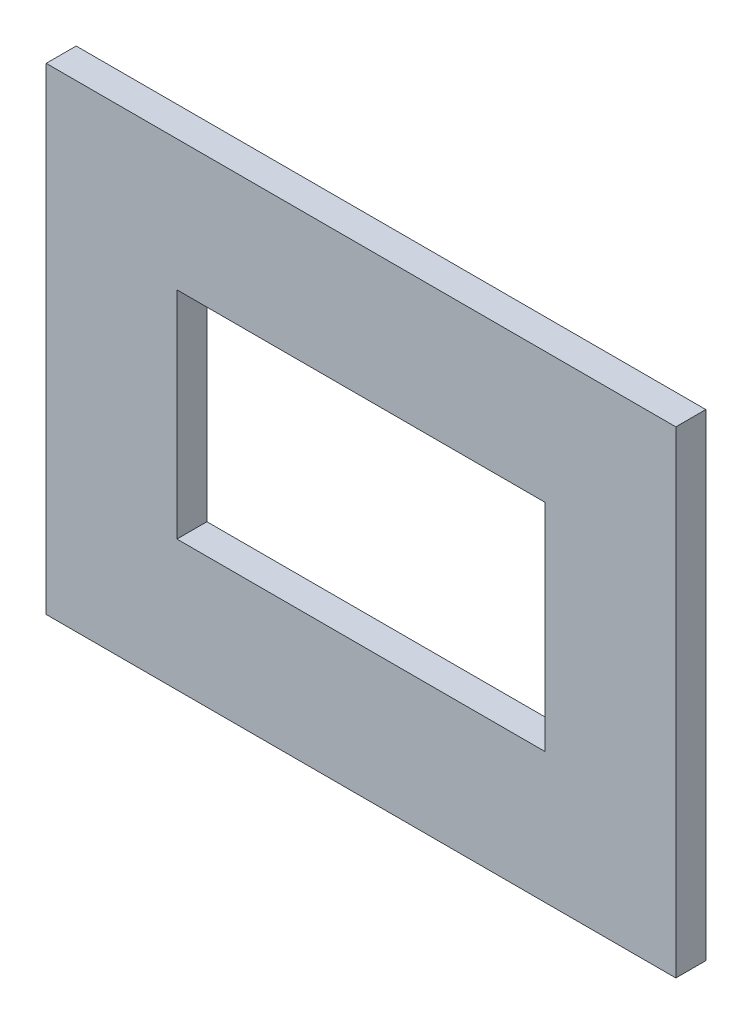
ISO-10303-21;
HEADER;
FILE_DESCRIPTION(('STEP AP214'),'2;1');
FILE_NAME('part.step','',(''),(''),'','','');
FILE_SCHEMA(('AUTOMOTIVE_DESIGN { 1 0 10303 214 1 1 1 1 }'));
ENDSEC;
DATA;
#1=APPLICATION_CONTEXT('core data for automotive mechanical design processes');
#2=APPLICATION_PROTOCOL_DEFINITION('international standard','automotive_design',2000,#1);
#3=PRODUCT_CONTEXT('',#1,'mechanical');
#4=PRODUCT('Part','Part','',(#3));
#5=PRODUCT_RELATED_PRODUCT_CATEGORY('part','',(#4));
#6=PRODUCT_DEFINITION_FORMATION('','',#4);
#7=PRODUCT_DEFINITION_CONTEXT('part definition',#1,'design');
#8=PRODUCT_DEFINITION('design','',#6,#7);
#9=PRODUCT_DEFINITION_SHAPE('','',#8);
#10=(LENGTH_UNIT() NAMED_UNIT(*) SI_UNIT(.MILLI.,.METRE.));
#11=(NAMED_UNIT(*) PLANE_ANGLE_UNIT() SI_UNIT($,.RADIAN.));
#12=(NAMED_UNIT(*) SI_UNIT($,.STERADIAN.) SOLID_ANGLE_UNIT());
#13=UNCERTAINTY_MEASURE_WITH_UNIT(LENGTH_MEASURE(1.E-05),#10,'distance_accuracy_value','');
#14=(GEOMETRIC_REPRESENTATION_CONTEXT(3) GLOBAL_UNCERTAINTY_ASSIGNED_CONTEXT((#13)) GLOBAL_UNIT_ASSIGNED_CONTEXT((#10,
#11,#12)) REPRESENTATION_CONTEXT('',''));
#15=CARTESIAN_POINT('',(0.,0.,0.));
#16=DIRECTION('',(0.,0.,1.));
#17=DIRECTION('',(1.,0.,0.));
#18=AXIS2_PLACEMENT_3D('',#15,#16,#17);
#19=CARTESIAN_POINT('',(0.,0.,15.));
#20=DIRECTION('',(0.,0.,1.));
#21=DIRECTION('',(1.,0.,0.));
#22=AXIS2_PLACEMENT_3D('',#19,#20,#21);
#23=PLANE('',#22);
#24=DIRECTION('',(1.,0.,0.));
#25=VECTOR('',#24,1.);
#26=CARTESIAN_POINT('',(-1.8801817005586E-13,-119.339078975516,15.));
#27=LINE('',#26,#25);
#28=CARTESIAN_POINT('',(-157.475,-119.339078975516,15.));
#29=VERTEX_POINT('',#28);
#30=CARTESIAN_POINT('',(157.439078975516,-119.339078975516,15.));
#31=VERTEX_POINT('',#30);
#32=EDGE_CURVE('E99',#29,#31,#27,.T.);
#33=ORIENTED_EDGE('',*,*,#32,.T.);
#34=DIRECTION('',(0.,1.,0.));
#35=VECTOR('',#34,1.);
#36=CARTESIAN_POINT('',(157.439078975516,1.80411241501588E-13,15.));
#37=LINE('',#36,#35);
#38=CARTESIAN_POINT('',(157.439078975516,119.375,15.));
#39=VERTEX_POINT('',#38);
#40=EDGE_CURVE('E105',#31,#39,#37,.T.);
#41=ORIENTED_EDGE('',*,*,#40,.T.);
#42=DIRECTION('',(1.,0.,0.));
#43=VECTOR('',#42,1.);
#44=CARTESIAN_POINT('',(1.82814087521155E-13,119.375,15.0000000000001));
#45=LINE('',#44,#43);
#46=CARTESIAN_POINT('',(-157.475,119.374999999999,15.0000000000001));
#47=VERTEX_POINT('',#46);
#48=EDGE_CURVE('E109',#47,#39,#45,.T.);
#49=ORIENTED_EDGE('',*,*,#48,.F.);
#50=DIRECTION('',(0.,1.,0.));
#51=VECTOR('',#50,1.);
#52=CARTESIAN_POINT('',(-157.475,-1.80411241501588E-13,15.));
#53=LINE('',#52,#51);
#54=EDGE_CURVE('E102',#29,#47,#53,.T.);
#55=ORIENTED_EDGE('',*,*,#54,.F.);
#56=EDGE_LOOP('',(#33,#41,#49,#55));
#57=FACE_BOUND('',#56,.T.);
#58=DIRECTION('',(1.,0.,0.));
#59=VECTOR('',#58,1.);
#60=CARTESIAN_POINT('',(92.075,-53.975,15.));
#61=LINE('',#60,#59);
#62=CARTESIAN_POINT('',(-92.0750000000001,-53.975,15.));
#63=VERTEX_POINT('',#62);
#64=CARTESIAN_POINT('',(92.075,-53.975,15.));
#65=VERTEX_POINT('',#64);
#66=EDGE_CURVE('E134',#63,#65,#61,.T.);
#67=ORIENTED_EDGE('',*,*,#66,.F.);
#68=DIRECTION('',(0.,-1.,0.));
#69=VECTOR('',#68,1.);
#70=CARTESIAN_POINT('',(-92.0750000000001,-53.975,15.));
#71=LINE('',#70,#69);
#72=CARTESIAN_POINT('',(-92.0750000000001,53.975,15.));
#73=VERTEX_POINT('',#72);
#74=EDGE_CURVE('E132',#73,#63,#71,.T.);
#75=ORIENTED_EDGE('',*,*,#74,.F.);
#76=DIRECTION('',(-1.,0.,0.));
#77=VECTOR('',#76,1.);
#78=CARTESIAN_POINT('',(92.075,53.975,15.));
#79=LINE('',#78,#77);
#80=CARTESIAN_POINT('',(92.075,53.975,15.));
#81=VERTEX_POINT('',#80);
#82=EDGE_CURVE('E140',#81,#73,#79,.T.);
#83=ORIENTED_EDGE('',*,*,#82,.F.);
#84=DIRECTION('',(0.,1.,0.));
#85=VECTOR('',#84,1.);
#86=CARTESIAN_POINT('',(92.075,-53.975,15.));
#87=LINE('',#86,#85);
#88=EDGE_CURVE('E137',#65,#81,#87,.T.);
#89=ORIENTED_EDGE('',*,*,#88,.F.);
#90=EDGE_LOOP('',(#67,#75,#83,#89));
#91=FACE_BOUND('',#90,.T.);
#92=ADVANCED_FACE('F32',(#57,#91),#23,.T.);
#93=CARTESIAN_POINT('',(0.,0.,0.));
#94=DIRECTION('',(0.,0.,1.));
#95=DIRECTION('',(1.,0.,0.));
#96=AXIS2_PLACEMENT_3D('',#93,#94,#95);
#97=PLANE('',#96);
#98=DIRECTION('',(0.,1.,0.));
#99=VECTOR('',#98,1.);
#100=CARTESIAN_POINT('',(157.439078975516,1.80411241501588E-13,0.));
#101=LINE('',#100,#99);
#102=CARTESIAN_POINT('',(157.439078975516,-119.339078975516,0.));
#103=VERTEX_POINT('',#102);
#104=CARTESIAN_POINT('',(157.439078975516,119.375,0.));
#105=VERTEX_POINT('',#104);
#106=EDGE_CURVE('E121',#103,#105,#101,.T.);
#107=ORIENTED_EDGE('',*,*,#106,.F.);
#108=DIRECTION('',(1.,0.,0.));
#109=VECTOR('',#108,1.);
#110=CARTESIAN_POINT('',(-1.8801817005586E-13,-119.339078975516,0.));
#111=LINE('',#110,#109);
#112=CARTESIAN_POINT('',(-157.475,-119.339078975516,0.));
#113=VERTEX_POINT('',#112);
#114=EDGE_CURVE('E55',#113,#103,#111,.T.);
#115=ORIENTED_EDGE('',*,*,#114,.F.);
#116=DIRECTION('',(0.,1.,0.));
#117=VECTOR('',#116,1.);
#118=CARTESIAN_POINT('',(-157.475,-1.80411241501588E-13,0.));
#119=LINE('',#118,#117);
#120=CARTESIAN_POINT('',(-157.475,119.374999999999,0.));
#121=VERTEX_POINT('',#120);
#122=EDGE_CURVE('E112',#113,#121,#119,.T.);
#123=ORIENTED_EDGE('',*,*,#122,.T.);
#124=DIRECTION('',(1.,0.,0.));
#125=VECTOR('',#124,1.);
#126=CARTESIAN_POINT('',(1.82814087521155E-13,119.375,0.));
#127=LINE('',#126,#125);
#128=EDGE_CURVE('E115',#121,#105,#127,.T.);
#129=ORIENTED_EDGE('',*,*,#128,.T.);
#130=EDGE_LOOP('',(#107,#115,#123,#129));
#131=FACE_BOUND('',#130,.T.);
#132=DIRECTION('',(0.,-1.,0.));
#133=VECTOR('',#132,1.);
#134=CARTESIAN_POINT('',(-92.0750000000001,-53.975,0.));
#135=LINE('',#134,#133);
#136=CARTESIAN_POINT('',(-92.0750000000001,53.975,0.));
#137=VERTEX_POINT('',#136);
#138=CARTESIAN_POINT('',(-92.0750000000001,-53.975,0.));
#139=VERTEX_POINT('',#138);
#140=EDGE_CURVE('E127',#137,#139,#135,.T.);
#141=ORIENTED_EDGE('',*,*,#140,.T.);
#142=DIRECTION('',(1.,0.,0.));
#143=VECTOR('',#142,1.);
#144=CARTESIAN_POINT('',(92.075,-53.975,0.));
#145=LINE('',#144,#143);
#146=CARTESIAN_POINT('',(92.075,-53.975,0.));
#147=VERTEX_POINT('',#146);
#148=EDGE_CURVE('E145',#139,#147,#145,.T.);
#149=ORIENTED_EDGE('',*,*,#148,.T.);
#150=DIRECTION('',(0.,1.,0.));
#151=VECTOR('',#150,1.);
#152=CARTESIAN_POINT('',(92.075,-53.975,0.));
#153=LINE('',#152,#151);
#154=CARTESIAN_POINT('',(92.075,53.975,0.));
#155=VERTEX_POINT('',#154);
#156=EDGE_CURVE('E148',#147,#155,#153,.T.);
#157=ORIENTED_EDGE('',*,*,#156,.T.);
#158=DIRECTION('',(-1.,0.,0.));
#159=VECTOR('',#158,1.);
#160=CARTESIAN_POINT('',(92.075,53.975,0.));
#161=LINE('',#160,#159);
#162=EDGE_CURVE('E135',#155,#137,#161,.T.);
#163=ORIENTED_EDGE('',*,*,#162,.T.);
#164=EDGE_LOOP('',(#141,#149,#157,#163));
#165=FACE_BOUND('',#164,.T.);
#166=ADVANCED_FACE('F34',(#131,#165),#97,.F.);
#167=CARTESIAN_POINT('',(-92.0750000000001,-53.975,15.));
#168=DIRECTION('',(1.,0.,0.));
#169=DIRECTION('',(0.,0.,-1.));
#170=AXIS2_PLACEMENT_3D('',#167,#168,#169);
#171=PLANE('',#170);
#172=ORIENTED_EDGE('',*,*,#140,.F.);
#173=DIRECTION('',(0.,0.,-1.));
#174=VECTOR('',#173,1.);
#175=CARTESIAN_POINT('',(-92.0750000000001,53.975,15.));
#176=LINE('',#175,#174);
#177=EDGE_CURVE('E142',#73,#137,#176,.T.);
#178=ORIENTED_EDGE('',*,*,#177,.F.);
#179=ORIENTED_EDGE('',*,*,#74,.T.);
#180=DIRECTION('',(0.,0.,-1.));
#181=VECTOR('',#180,1.);
#182=CARTESIAN_POINT('',(-92.0750000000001,-53.975,15.));
#183=LINE('',#182,#181);
#184=EDGE_CURVE('E11',#63,#139,#183,.T.);
#185=ORIENTED_EDGE('',*,*,#184,.T.);
#186=EDGE_LOOP('',(#172,#178,#179,#185));
#187=FACE_BOUND('',#186,.T.);
#188=ADVANCED_FACE('F169',(#187),#171,.T.);
#189=CARTESIAN_POINT('',(92.075,-53.975,15.));
#190=DIRECTION('',(0.,1.,0.));
#191=DIRECTION('',(-1.,0.,0.));
#192=AXIS2_PLACEMENT_3D('',#189,#190,#191);
#193=PLANE('',#192);
#194=ORIENTED_EDGE('',*,*,#148,.F.);
#195=ORIENTED_EDGE('',*,*,#184,.F.);
#196=ORIENTED_EDGE('',*,*,#66,.T.);
#197=DIRECTION('',(0.,0.,-1.));
#198=VECTOR('',#197,1.);
#199=CARTESIAN_POINT('',(92.075,-53.975,15.));
#200=LINE('',#199,#198);
#201=EDGE_CURVE('E40',#65,#147,#200,.T.);
#202=ORIENTED_EDGE('',*,*,#201,.T.);
#203=EDGE_LOOP('',(#194,#195,#196,#202));
#204=FACE_BOUND('',#203,.T.);
#205=ADVANCED_FACE('F159',(#204),#193,.T.);
#206=CARTESIAN_POINT('',(92.075,-53.975,15.));
#207=DIRECTION('',(-1.,0.,0.));
#208=DIRECTION('',(0.,0.,1.));
#209=AXIS2_PLACEMENT_3D('',#206,#207,#208);
#210=PLANE('',#209);
#211=ORIENTED_EDGE('',*,*,#156,.F.);
#212=ORIENTED_EDGE('',*,*,#201,.F.);
#213=ORIENTED_EDGE('',*,*,#88,.T.);
#214=DIRECTION('',(0.,0.,-1.));
#215=VECTOR('',#214,1.);
#216=CARTESIAN_POINT('',(92.075,53.975,15.));
#217=LINE('',#216,#215);
#218=EDGE_CURVE('E155',#81,#155,#217,.T.);
#219=ORIENTED_EDGE('',*,*,#218,.T.);
#220=EDGE_LOOP('',(#211,#212,#213,#219));
#221=FACE_BOUND('',#220,.T.);
#222=ADVANCED_FACE('F164',(#221),#210,.T.);
#223=CARTESIAN_POINT('',(92.075,53.975,15.));
#224=DIRECTION('',(0.,-1.,0.));
#225=DIRECTION('',(1.,0.,0.));
#226=AXIS2_PLACEMENT_3D('',#223,#224,#225);
#227=PLANE('',#226);
#228=ORIENTED_EDGE('',*,*,#162,.F.);
#229=ORIENTED_EDGE('',*,*,#218,.F.);
#230=ORIENTED_EDGE('',*,*,#82,.T.);
#231=ORIENTED_EDGE('',*,*,#177,.T.);
#232=EDGE_LOOP('',(#228,#229,#230,#231));
#233=FACE_BOUND('',#232,.T.);
#234=ADVANCED_FACE('F172',(#233),#227,.T.);
#235=CARTESIAN_POINT('',(-1.8801817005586E-13,-119.339078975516,15.));
#236=DIRECTION('',(0.,1.,0.));
#237=DIRECTION('',(-1.,0.,0.));
#238=AXIS2_PLACEMENT_3D('',#235,#236,#237);
#239=PLANE('',#238);
#240=ORIENTED_EDGE('',*,*,#114,.T.);
#241=DIRECTION('',(0.,0.,-1.));
#242=VECTOR('',#241,1.);
#243=CARTESIAN_POINT('',(157.439078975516,-119.339078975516,15.));
#244=LINE('',#243,#242);
#245=EDGE_CURVE('E96',#31,#103,#244,.T.);
#246=ORIENTED_EDGE('',*,*,#245,.F.);
#247=ORIENTED_EDGE('',*,*,#32,.F.);
#248=DIRECTION('',(0.,0.,-1.));
#249=VECTOR('',#248,1.);
#250=CARTESIAN_POINT('',(-157.475,-119.339078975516,15.));
#251=LINE('',#250,#249);
#252=EDGE_CURVE('E125',#29,#113,#251,.T.);
#253=ORIENTED_EDGE('',*,*,#252,.T.);
#254=EDGE_LOOP('',(#240,#246,#247,#253));
#255=FACE_BOUND('',#254,.T.);
#256=ADVANCED_FACE('F97',(#255),#239,.F.);
#257=CARTESIAN_POINT('',(-157.475,-1.80411241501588E-13,15.));
#258=DIRECTION('',(-1.,0.,0.));
#259=DIRECTION('',(0.,-1.,0.));
#260=AXIS2_PLACEMENT_3D('',#257,#258,#259);
#261=PLANE('',#260);
#262=ORIENTED_EDGE('',*,*,#122,.F.);
#263=ORIENTED_EDGE('',*,*,#252,.F.);
#264=ORIENTED_EDGE('',*,*,#54,.T.);
#265=DIRECTION('',(0.,0.,-1.));
#266=VECTOR('',#265,1.);
#267=CARTESIAN_POINT('',(-157.475,119.374999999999,15.0000000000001));
#268=LINE('',#267,#266);
#269=EDGE_CURVE('E128',#47,#121,#268,.T.);
#270=ORIENTED_EDGE('',*,*,#269,.T.);
#271=EDGE_LOOP('',(#262,#263,#264,#270));
#272=FACE_BOUND('',#271,.T.);
#273=ADVANCED_FACE('F190',(#272),#261,.T.);
#274=CARTESIAN_POINT('',(1.82814087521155E-13,119.375,15.0000000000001));
#275=DIRECTION('',(0.,1.,0.));
#276=DIRECTION('',(-1.,0.,0.));
#277=AXIS2_PLACEMENT_3D('',#274,#275,#276);
#278=PLANE('',#277);
#279=ORIENTED_EDGE('',*,*,#128,.F.);
#280=ORIENTED_EDGE('',*,*,#269,.F.);
#281=ORIENTED_EDGE('',*,*,#48,.T.);
#282=DIRECTION('',(0.,0.,-1.));
#283=VECTOR('',#282,1.);
#284=CARTESIAN_POINT('',(157.439078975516,119.375,15.0000000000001));
#285=LINE('',#284,#283);
#286=EDGE_CURVE('E47',#39,#105,#285,.T.);
#287=ORIENTED_EDGE('',*,*,#286,.T.);
#288=EDGE_LOOP('',(#279,#280,#281,#287));
#289=FACE_BOUND('',#288,.T.);
#290=ADVANCED_FACE('F193',(#289),#278,.T.);
#291=CARTESIAN_POINT('',(157.439078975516,1.80411241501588E-13,15.));
#292=DIRECTION('',(-1.,0.,0.));
#293=DIRECTION('',(0.,-1.,0.));
#294=AXIS2_PLACEMENT_3D('',#291,#292,#293);
#295=PLANE('',#294);
#296=ORIENTED_EDGE('',*,*,#106,.T.);
#297=ORIENTED_EDGE('',*,*,#286,.F.);
#298=ORIENTED_EDGE('',*,*,#40,.F.);
#299=ORIENTED_EDGE('',*,*,#245,.T.);
#300=EDGE_LOOP('',(#296,#297,#298,#299));
#301=FACE_BOUND('',#300,.T.);
#302=ADVANCED_FACE('F106',(#301),#295,.F.);
#303=CLOSED_SHELL('',(#92,#166,#188,#205,#222,#234,#256,#273,#290,#302));
#304=MANIFOLD_SOLID_BREP('B2',#303);
#305=ADVANCED_BREP_SHAPE_REPRESENTATION('',(#18,#304),#14);
#306=SHAPE_DEFINITION_REPRESENTATION(#9,#305);
ENDSEC;
END-ISO-10303-21;
